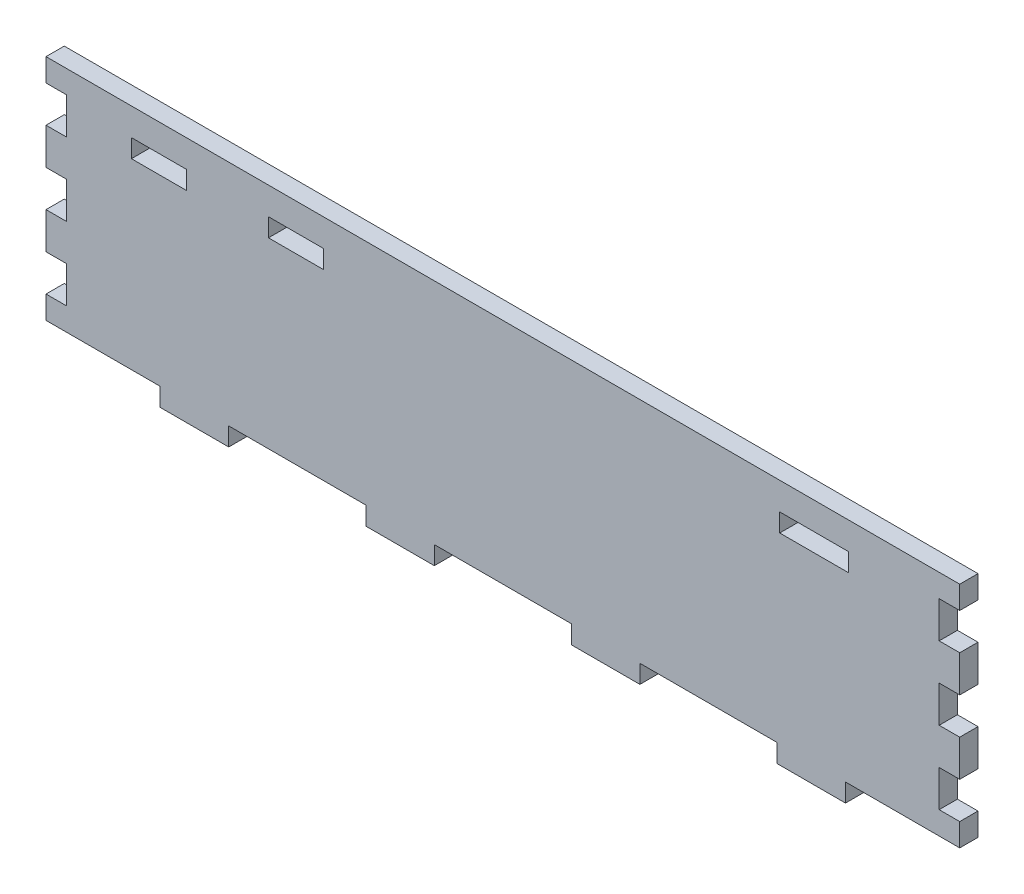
from build123d import *

# Parameters (mm, degrees)
SKETCH1_W           = 12
SKETCH1_H           = 4
SKETCH1_W_2         = 15
BOSS_EXTRUDE1_DEPTH = 2


with BuildPart() as part:
    # Sketch1 → Boss-Extrude1 (new, symmetric)
    with BuildSketch(Plane.XY):
        Polygon((75, 0), (100, 0), (100, 5), (95.5, 5), (95.5, 13), (100, 13), (100, 21), (95.5, 21), (95.5, 29), (100, 29), (100, 37), (95.5, 37), (95.5, 45), (100, 45), (100, 50), (-100, 50), (-100, 45), (-95.5, 45), (-95.5, 37), (-100, 37), (-100, 29), (-95.5, 29), (-95.5, 21), (-100, 21), (-100, 13), (-95.5, 13), (-95.5, 5), (-100, 5), (-100, 0), (-75, 0), (-75, -4), (-60, -4), (-60, 0), (-30, 0), (-30, -4), (-15, -4), (-15, 0), (15, 0), (15, -4), (30, -4), (30, 0), (60, 0), (60, -4), (75, -4), align=None)
        with Locations((-45.3, 42)):
            Rectangle(SKETCH1_W, SKETCH1_H, mode=Mode.SUBTRACT)
        with Locations((-75.3, 42)):
            Rectangle(SKETCH1_W, SKETCH1_H, mode=Mode.SUBTRACT)
        with Locations((68.1, 42)):
            Rectangle(SKETCH1_W_2, SKETCH1_H, mode=Mode.SUBTRACT)
    extrude(amount=BOSS_EXTRUDE1_DEPTH, both=True)


solid = part.part
